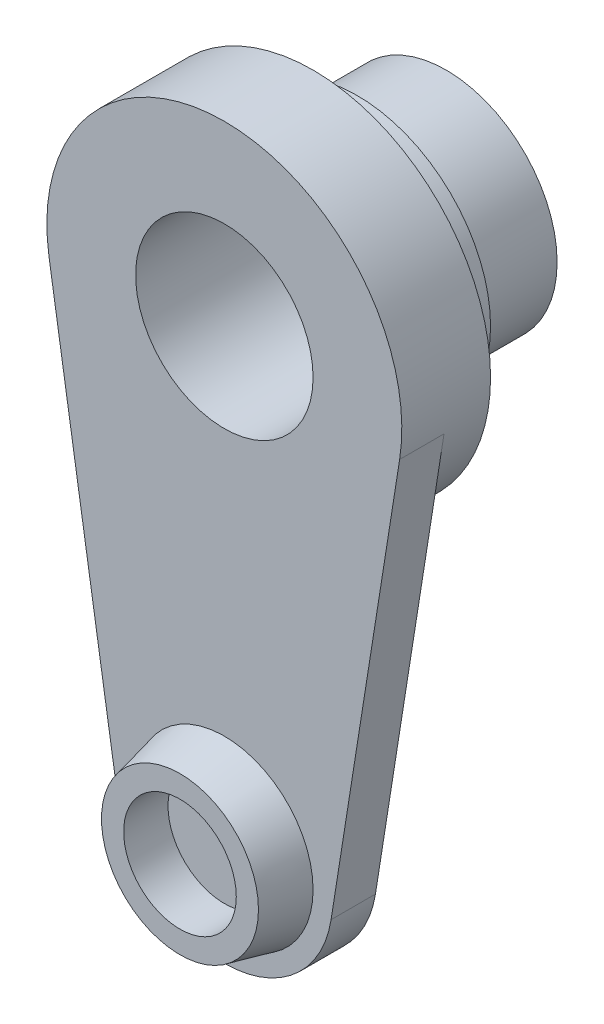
from build123d import *

# Parameters (mm, degrees)
SKETCH1_R          = 7.9375
SKETCH1_R_2        = 6.35
EXTRUDE1_DEPTH     = 6.35
SKETCH2_R          = 9.525
SKETCH2_R_2        = 6.35
EXTRUDE2_DEPTH     = 3.175
SKETCH3_R          = 12.7
SKETCH3_R_2        = 6.35
EXTRUDE3_DEPTH     = 3.175
SKETCH5_R          = 6.35
EXTRUDE5_DEPTH     = 3.175
SKETCH6_R          = 6.35
EXTRUDE6_DEPTH     = 3.175
EXTRUDE6_TAPER     = 13
SKETCH7_R          = 4.029493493
CUT_EXTRUDE1_DEPTH = 3.175


with BuildPart() as part:
    # Sketch1 → Extrude1 (new body)
    with BuildSketch(Plane.XY):
        Circle(SKETCH1_R)
        Circle(SKETCH1_R_2, mode=Mode.SUBTRACT)
    extrude(amount=EXTRUDE1_DEPTH)

    # Sketch2 → Extrude2 (add)
    with BuildSketch(Plane.XY.offset(6.35)):
        Circle(SKETCH2_R)
        Circle(SKETCH2_R_2, mode=Mode.SUBTRACT)
    extrude(amount=EXTRUDE2_DEPTH)

    # Sketch3 → Extrude3 (add)
    with BuildSketch(Plane.XY.offset(9.525)):
        with Locations(Location((0, 0, 0), (0, 0, 189))):
            Circle(SKETCH3_R)
        Circle(SKETCH3_R_2, mode=Mode.SUBTRACT)
    extrude(amount=EXTRUDE3_DEPTH)

    # Sketch5 → Extrude5 (add)
    with BuildSketch(Plane.XY.offset(12.7)):
        with BuildLine():
            Line((12.543641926, -1.986717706), (7.63799714, -32.959739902))
            ThreePointArc((7.63799714, -32.959739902), (0, -39.483205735), (-7.63799714, -32.959739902))
            Line((-7.63799714, -32.959739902), (-12.543641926, -1.986717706))
            ThreePointArc((-12.543641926, -1.986717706), (0, 12.7), (12.543641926, -1.986717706))
        make_face()
        Circle(SKETCH5_R, mode=Mode.SUBTRACT)
    extrude(amount=EXTRUDE5_DEPTH)

    # Sketch6 → Extrude6 (add)
    with BuildSketch(Plane.XY.offset(15.875)):
        with Locations((0, -31.75)):
            Circle(SKETCH6_R)
    extrude(amount=EXTRUDE6_DEPTH, taper=EXTRUDE6_TAPER)

    # Sketch7 → Cut-Extrude1 (cut)
    with BuildSketch(Plane.XY.offset(19.05)):
        with Locations((0, -31.75)):
            Circle(SKETCH7_R)
    extrude(amount=-CUT_EXTRUDE1_DEPTH, mode=Mode.SUBTRACT)


solid = part.part
